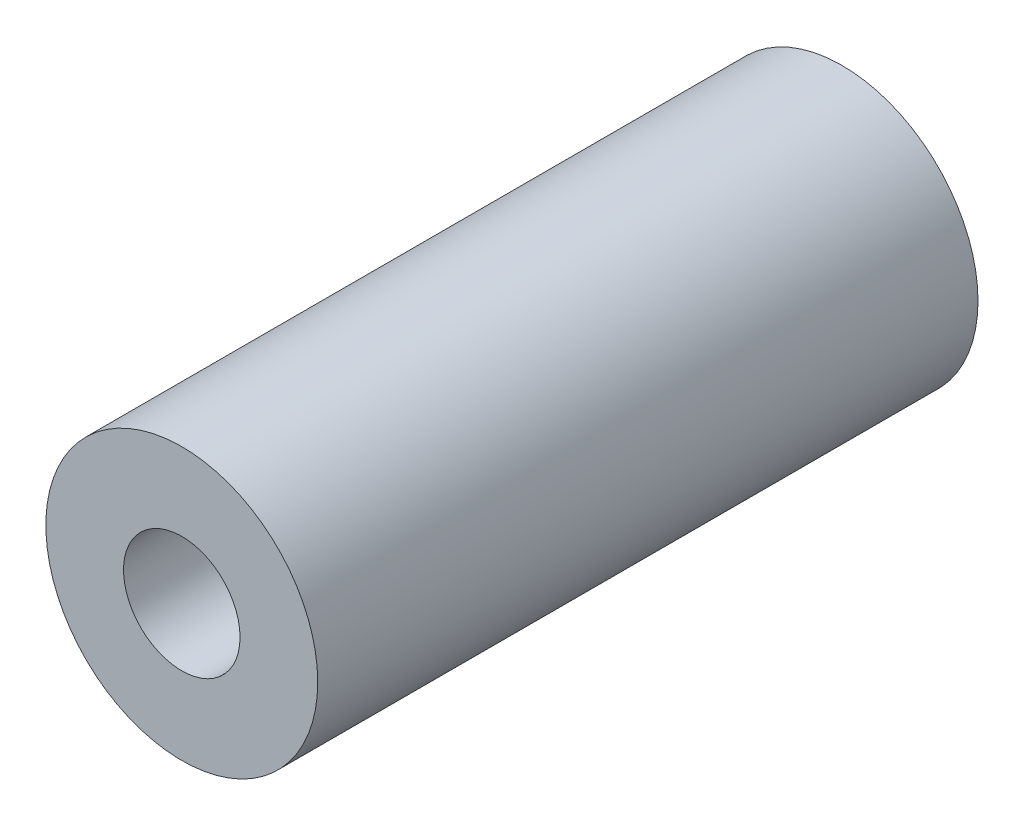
from build123d import *

# Parameters (mm, degrees)
SKETCH1_R           = 11.1125
SKETCH1_R_2         = 4.7625
BOSS_EXTRUDE1_DEPTH = 53.975


with BuildPart() as part:
    # Sketch1 → Boss-Extrude1 (new body)
    with BuildSketch(Plane.XY):
        Circle(SKETCH1_R)
        Circle(SKETCH1_R_2, mode=Mode.SUBTRACT)
    extrude(amount=BOSS_EXTRUDE1_DEPTH)


solid = part.part
